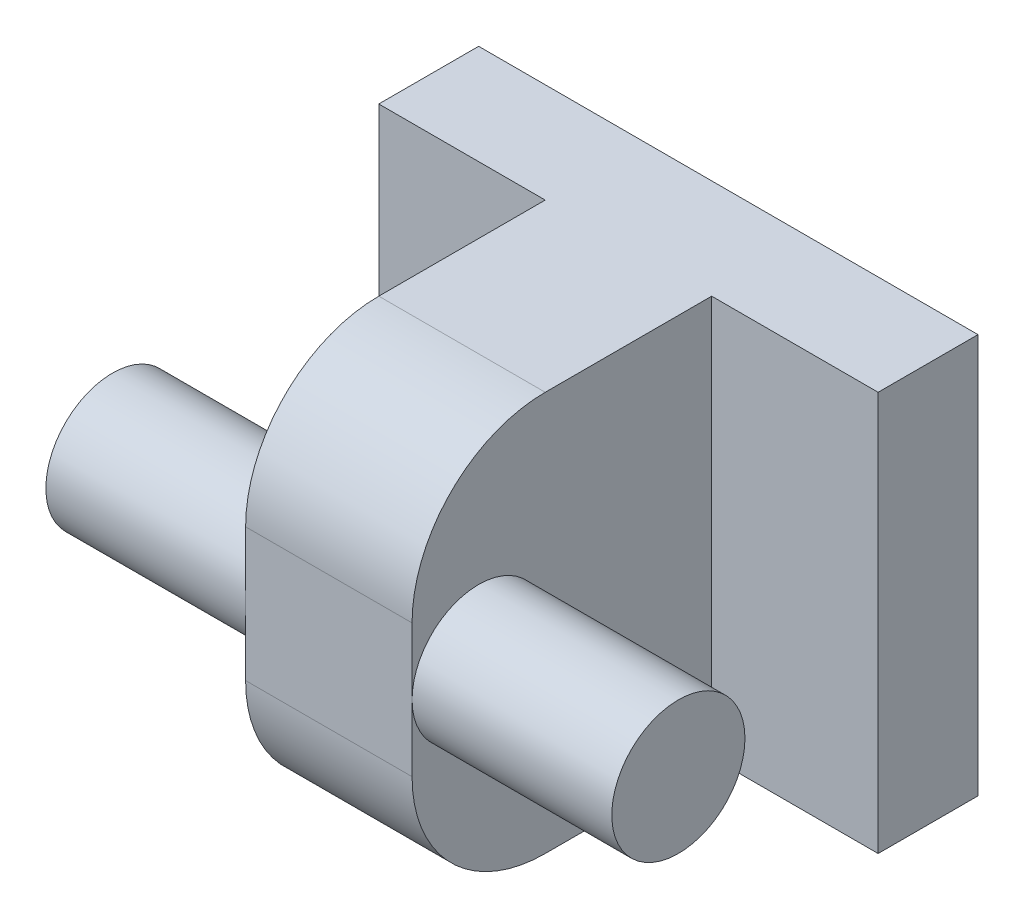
from build123d import *

# Parameters (mm, degrees)
SKETCH_1_W           = 150
SKETCH_1_H           = 120
EXTRUDE_1_DEPTH      = 30
SKETCH_2_W           = 50
SKETCH_2_H           = 120
EXTRUDE_2_DEPTH      = 90
EXTRUDE_3_DEPTH      = 60
EXTRUDE_3_DEPTH_BACK = 110
SKETCH_3_R           = 20
FILLET_1_R           = 40
SKETCH_4_R           = 20
CUT_EXTRUDE_4_DEPTH  = 40


with BuildPart() as part:
    # Sketch 1 → Extrude 1 (new body)
    with BuildSketch(Plane.XY):
        with Locations((75, 60)):
            Rectangle(SKETCH_1_W, SKETCH_1_H)
    extrude(amount=EXTRUDE_1_DEPTH)

    # Sketch 2 → Extrude 2 (add)
    with BuildSketch(Plane.XY.offset(30)):
        with Locations((75, 60)):
            Rectangle(SKETCH_2_W, SKETCH_2_H)
    extrude(amount=EXTRUDE_2_DEPTH)

    # Sketch 3 → Extrude 3 (add, two sides: drawn at the far end of the back side and taken through both)
    with BuildSketch(Plane(origin=(100, 0, 0), x_dir=(0, 0, -1), z_dir=(1, 0, 0)).offset(-EXTRUDE_3_DEPTH_BACK)):
        with Locations((-100, 60)):
            Circle(SKETCH_3_R)
    extrude(amount=EXTRUDE_3_DEPTH + EXTRUDE_3_DEPTH_BACK)

    # Fillet 1
    fillet_1_edges = [part.edges().sort_by_distance(p)[0] for p in [
        (75, 120, 120),
        (75, 0, 120),
    ]]
    fillet(fillet_1_edges, radius=FILLET_1_R)

    # Sketch 4 → Cut-Extrude 4 (cut)
    with BuildSketch(Plane(origin=(0, 0, 0), x_dir=(-1, 0, 0), z_dir=(0, 0, -1))):
        with Locations((-75, 60)):
            Circle(SKETCH_4_R)
    extrude(amount=-CUT_EXTRUDE_4_DEPTH, mode=Mode.SUBTRACT)


solid = part.part
